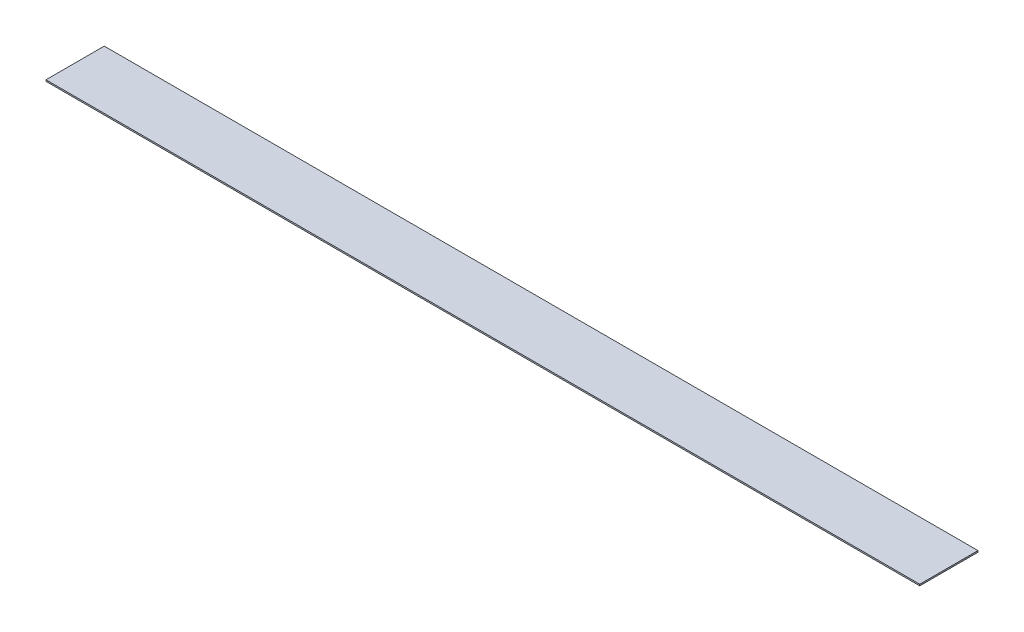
from build123d import *

# Parameters (mm, degrees)
SCHIZZO1_W        = 6000
SCHIZZO1_H        = 400
ESTRUSIONE1_DEPTH = 10


with BuildPart() as part:
    # Schizzo1 → Estrusione1 (new body)
    with BuildSketch(Plane(origin=(0, 0, 0), x_dir=(1, 0, 0), z_dir=(0, 1, 0))):
        with Locations((3000, 0)):
            Rectangle(SCHIZZO1_W, SCHIZZO1_H)
    extrude(amount=ESTRUSIONE1_DEPTH)


solid = part.part
